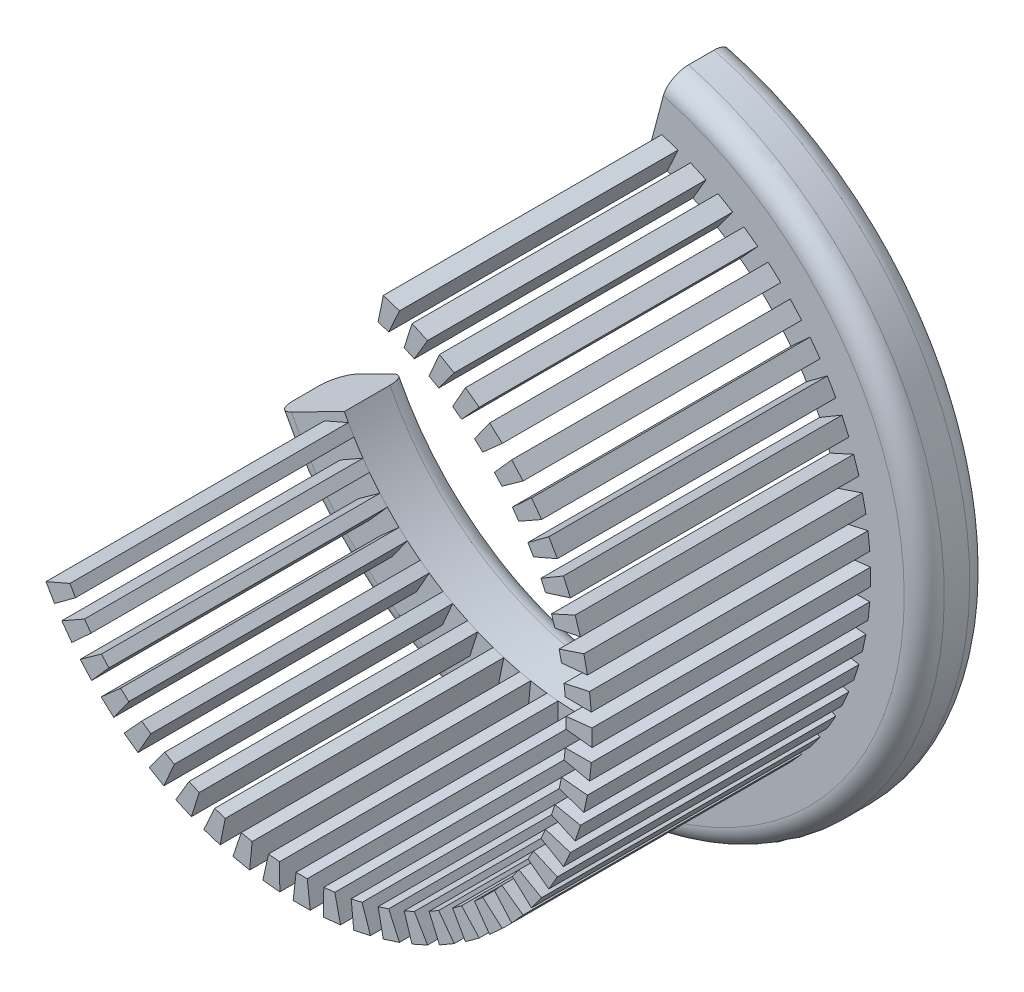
from build123d import *

# Parameters (mm, degrees)
P_IDAT_VYSUNUT_M1_DEPTH    = 85
P_IDAT_VYSUNUT_M1_2_DEPTH  = 85
P_IDAT_VYSUNUT_M1_3_DEPTH  = 85
P_IDAT_VYSUNUT_M1_4_DEPTH  = 85
P_IDAT_VYSUNUT_M1_5_DEPTH  = 85
P_IDAT_VYSUNUT_M1_6_DEPTH  = 85
P_IDAT_VYSUNUT_M1_7_DEPTH  = 85
P_IDAT_VYSUNUT_M1_8_DEPTH  = 85
P_IDAT_VYSUNUT_M1_9_DEPTH  = 85
P_IDAT_VYSUNUT_M1_10_DEPTH = 85
P_IDAT_VYSUNUT_M1_11_DEPTH = 85
P_IDAT_VYSUNUT_M1_12_DEPTH = 85
P_IDAT_VYSUNUT_M1_13_DEPTH = 85
P_IDAT_VYSUNUT_M1_14_DEPTH = 85
P_IDAT_VYSUNUT_M1_15_DEPTH = 85
P_IDAT_VYSUNUT_M1_16_DEPTH = 85
P_IDAT_VYSUNUT_M1_17_DEPTH = 85
P_IDAT_VYSUNUT_M1_18_DEPTH = 85
P_IDAT_VYSUNUT_M1_19_DEPTH = 85
P_IDAT_VYSUNUT_M1_20_DEPTH = 85
P_IDAT_VYSUNUT_M1_21_DEPTH = 85
P_IDAT_VYSUNUT_M1_22_DEPTH = 85
P_IDAT_VYSUNUT_M1_23_DEPTH = 85
P_IDAT_VYSUNUT_M1_24_DEPTH = 85
P_IDAT_VYSUNUT_M1_25_DEPTH = 85
P_IDAT_VYSUNUT_M1_26_DEPTH = 85
P_IDAT_VYSUNUT_M1_27_DEPTH = 85
P_IDAT_VYSUNUT_M1_28_DEPTH = 85
P_IDAT_VYSUNUT_M1_29_DEPTH = 85
P_IDAT_VYSUNUT_M1_30_DEPTH = 85
P_IDAT_VYSUNUT_M1_31_DEPTH = 85
P_IDAT_VYSUNUT_M1_32_DEPTH = 85
P_IDAT_VYSUNUT_M1_33_DEPTH = 85
P_IDAT_VYSUNUT_M1_34_DEPTH = 85
P_IDAT_VYSUNUT_M1_35_DEPTH = 85
P_IDAT_VYSUNUT_M1_36_DEPTH = 85
P_IDAT_VYSUNUT_M1_37_DEPTH = 85
P_IDAT_VYSUNUT_M1_38_DEPTH = 85
P_IDAT_VYSUNUT_M1_39_DEPTH = 85
P_IDAT_VYSUNUT_M1_40_DEPTH = 85
P_IDAT_VYSUNUT_M1_41_DEPTH = 85
P_IDAT_VYSUNUT_M1_42_DEPTH = 85
P_IDAT_VYSUNUT_M1_43_DEPTH = 85
P_IDAT_VYSUNUT_M1_44_DEPTH = 85
P_IDAT_VYSUNUT_M1_45_DEPTH = 85
P_IDAT_VYSUNUT_M1_46_DEPTH = 85
P_IDAT_VYSUNUT_M1_47_DEPTH = 85
P_IDAT_VYSUNUT_M1_48_DEPTH = 85
P_IDAT_VYSUNUT_M1_49_DEPTH = 85
P_IDAT_VYSUNUT_M1_50_DEPTH = 85
P_IDAT_VYSUNUT_M1_51_DEPTH = 85
P_IDAT_VYSUNUT_M1_52_DEPTH = 85
P_IDAT_VYSUNUT_M1_53_DEPTH = 85
P_IDAT_VYSUNUT_M1_54_DEPTH = 85
P_IDAT_VYSUNUT_M1_55_DEPTH = 85
P_IDAT_VYSUNUT_M1_56_DEPTH = 85
P_IDAT_VYSUNUT_M1_57_DEPTH = 85
P_IDAT_VYSUNUT_M1_58_DEPTH = 85
P_IDAT_VYSUNUT_M1_59_DEPTH = 85
P_IDAT_VYSUNUT_M1_60_DEPTH = 85
SKICA2_R                   = 105
SKICA2_R_2                 = 80.717903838
P_IDAT_VYSUNUT_M2_DEPTH    = 20
M_TKO1_SCALE               = 0.655
ODEBRAT_VYSUNUT_M1_DEPTH   = 120.121794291
ZAOBLIT1_R                 = 4


with BuildPart() as part:
    # Skica1 → P_idat vysunut_m1 (new body)
    with BuildSketch(Plane.XY):
        Polygon((-2.6, 88.6), (2.6, 88.6), (1.7, 80.7), (-1.7, 80.7), align=None)
    extrude(amount=P_IDAT_VYSUNUT_M1_DEPTH)



with BuildPart() as body_2:
    # Skica1 → P_idat vysunut_m1 2 (new body)
    with BuildSketch(Plane.XY):
        Polygon((6.744759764, 80.435615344), (10.126134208, 80.080218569), (11.846978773, 87.842865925), (6.675464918, 88.386413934), align=None)
    extrude(amount=P_IDAT_VYSUNUT_M1_2_DEPTH)


with BuildPart() as body_3:
    # Skica1 → P_idat vysunut_m1 3 (new body)
    with BuildSketch(Plane.XY):
        Polygon((15.115622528, 79.289961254), (18.44132437, 78.583061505), (20.964159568, 86.123307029), (15.877792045, 87.204447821), align=None)
    extrude(amount=P_IDAT_VYSUNUT_M1_3_DEPTH)


with BuildPart() as body_4:
    # Skica1 → P_idat vysunut_m1 4 (new body)
    with BuildSketch(Plane.XY):
        Polygon((23.320875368, 77.275589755), (26.554467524, 76.224931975), (29.851652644, 83.460163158), (24.906158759, 85.067051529), align=None)
    extrude(amount=P_IDAT_VYSUNUT_M1_4_DEPTH)


with BuildPart() as body_5:
    # Skica1 → P_idat vysunut_m1 5 (new body)
    with BuildSketch(Plane.XY):
        Polygon((31.270619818, 74.414570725), (34.376674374, 73.031666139), (38.412084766, 79.882612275), (33.661648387, 81.997642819), align=None)
    extrude(amount=P_IDAT_VYSUNUT_M1_5_DEPTH)


with BuildPart() as body_6:
    # Skica1 → P_idat vysunut_m1 6 (new body)
    with BuildSketch(Plane.XY):
        Polygon((38.877756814, 70.738250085), (41.822243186, 69.038250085), (46.55166605, 75.429850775), (42.04833395, 78.029850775), align=None)
    extrude(amount=P_IDAT_VYSUNUT_M1_6_DEPTH)


with BuildPart() as body_7:
    # Skica1 → P_idat vysunut_m1 7 (new body)
    with BuildSketch(Plane.XY):
        Polygon((46.05894097, 66.286906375), (48.80959875, 64.288436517), (54.181217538, 70.150664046), (49.974329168, 73.207147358), align=None)
    extrude(amount=P_IDAT_VYSUNUT_M1_7_DEPTH)


with BuildPart() as body_8:
    # Skica1 → P_idat vysunut_m1 8 (new body)
    with BuildSketch(Plane.XY):
        Polygon((52.73549373, 61.109309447), (55.262186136, 58.834265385), (61.21714827, 64.102891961), (57.352795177, 67.582371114), align=None)
    extrude(amount=P_IDAT_VYSUNUT_M1_8_DEPTH)


with BuildPart() as body_9:
    # Skica1 → P_idat vysunut_m1 9 (new body)
    with BuildSketch(Plane.XY):
        Polygon((58.834265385, 55.262186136), (61.109309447, 52.73549373), (67.582371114, 57.352795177), (64.102891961, 61.21714827), align=None)
    extrude(amount=P_IDAT_VYSUNUT_M1_9_DEPTH)


with BuildPart() as body_10:
    # Skica1 → P_idat vysunut_m1 10 (new body)
    with BuildSketch(Plane.XY):
        Polygon((64.288436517, 48.80959875), (66.286906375, 46.05894097), (73.207147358, 49.974329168), (70.150664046, 54.181217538), align=None)
    extrude(amount=P_IDAT_VYSUNUT_M1_10_DEPTH)


with BuildPart() as body_11:
    # Skica1 → P_idat vysunut_m1 11 (new body)
    with BuildSketch(Plane.XY):
        Polygon((69.038250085, 41.822243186), (70.738250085, 38.877756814), (78.029850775, 42.04833395), (75.429850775, 46.55166605), align=None)
    extrude(amount=P_IDAT_VYSUNUT_M1_11_DEPTH)


with BuildPart() as body_12:
    # Skica1 → P_idat vysunut_m1 12 (new body)
    with BuildSketch(Plane.XY):
        Polygon((73.031666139, 34.376674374), (74.414570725, 31.270619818), (81.997642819, 33.661648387), (79.882612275, 38.412084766), align=None)
    extrude(amount=P_IDAT_VYSUNUT_M1_12_DEPTH)


with BuildPart() as body_13:
    # Skica1 → P_idat vysunut_m1 13 (new body)
    with BuildSketch(Plane.XY):
        Polygon((76.224931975, 26.554467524), (77.275589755, 23.320875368), (85.067051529, 24.906158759), (83.460163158, 29.851652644), align=None)
    extrude(amount=P_IDAT_VYSUNUT_M1_13_DEPTH)


with BuildPart() as body_14:
    # Skica1 → P_idat vysunut_m1 14 (new body)
    with BuildSketch(Plane.XY):
        Polygon((78.583061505, 18.44132437), (79.289961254, 15.115622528), (87.204447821, 15.877792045), (86.123307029, 20.964159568), align=None)
    extrude(amount=P_IDAT_VYSUNUT_M1_14_DEPTH)


with BuildPart() as body_15:
    # Skica1 → P_idat vysunut_m1 15 (new body)
    with BuildSketch(Plane.XY):
        Polygon((80.080218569, 10.126134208), (80.435615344, 6.744759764), (88.386413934, 6.675464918), (87.842865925, 11.846978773), align=None)
    extrude(amount=P_IDAT_VYSUNUT_M1_15_DEPTH)


with BuildPart() as body_16:
    # Skica1 → P_idat vysunut_m1 16 (new body)
    with BuildSketch(Plane.XY):
        Polygon((80.7, 1.7), (80.7, -1.7), (88.6, -2.6), (88.6, 2.6), align=None)
    extrude(amount=P_IDAT_VYSUNUT_M1_16_DEPTH)


with BuildPart() as body_17:
    # Skica1 → P_idat vysunut_m1 17 (new body)
    with BuildSketch(Plane.XY):
        Polygon((80.435615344, -6.744759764), (80.080218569, -10.126134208), (87.842865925, -11.846978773), (88.386413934, -6.675464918), align=None)
    extrude(amount=P_IDAT_VYSUNUT_M1_17_DEPTH)


with BuildPart() as body_18:
    # Skica1 → P_idat vysunut_m1 18 (new body)
    with BuildSketch(Plane.XY):
        Polygon((79.289961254, -15.115622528), (78.583061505, -18.44132437), (86.123307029, -20.964159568), (87.204447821, -15.877792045), align=None)
    extrude(amount=P_IDAT_VYSUNUT_M1_18_DEPTH)


with BuildPart() as body_19:
    # Skica1 → P_idat vysunut_m1 19 (new body)
    with BuildSketch(Plane.XY):
        Polygon((77.275589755, -23.320875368), (76.224931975, -26.554467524), (83.460163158, -29.851652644), (85.067051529, -24.906158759), align=None)
    extrude(amount=P_IDAT_VYSUNUT_M1_19_DEPTH)


with BuildPart() as body_20:
    # Skica1 → P_idat vysunut_m1 20 (new body)
    with BuildSketch(Plane.XY):
        Polygon((74.414570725, -31.270619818), (73.031666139, -34.376674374), (79.882612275, -38.412084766), (81.997642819, -33.661648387), align=None)
    extrude(amount=P_IDAT_VYSUNUT_M1_20_DEPTH)


with BuildPart() as body_21:
    # Skica1 → P_idat vysunut_m1 21 (new body)
    with BuildSketch(Plane.XY):
        Polygon((70.738250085, -38.877756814), (69.038250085, -41.822243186), (75.429850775, -46.55166605), (78.029850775, -42.04833395), align=None)
    extrude(amount=P_IDAT_VYSUNUT_M1_21_DEPTH)


with BuildPart() as body_22:
    # Skica1 → P_idat vysunut_m1 22 (new body)
    with BuildSketch(Plane.XY):
        Polygon((66.286906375, -46.05894097), (64.288436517, -48.80959875), (70.150664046, -54.181217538), (73.207147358, -49.974329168), align=None)
    extrude(amount=P_IDAT_VYSUNUT_M1_22_DEPTH)


with BuildPart() as body_23:
    # Skica1 → P_idat vysunut_m1 23 (new body)
    with BuildSketch(Plane.XY):
        Polygon((61.109309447, -52.73549373), (58.834265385, -55.262186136), (64.102891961, -61.21714827), (67.582371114, -57.352795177), align=None)
    extrude(amount=P_IDAT_VYSUNUT_M1_23_DEPTH)


with BuildPart() as body_24:
    # Skica1 → P_idat vysunut_m1 24 (new body)
    with BuildSketch(Plane.XY):
        Polygon((55.262186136, -58.834265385), (52.73549373, -61.109309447), (57.352795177, -67.582371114), (61.21714827, -64.102891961), align=None)
    extrude(amount=P_IDAT_VYSUNUT_M1_24_DEPTH)


with BuildPart() as body_25:
    # Skica1 → P_idat vysunut_m1 25 (new body)
    with BuildSketch(Plane.XY):
        Polygon((48.80959875, -64.288436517), (46.05894097, -66.286906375), (49.974329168, -73.207147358), (54.181217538, -70.150664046), align=None)
    extrude(amount=P_IDAT_VYSUNUT_M1_25_DEPTH)


with BuildPart() as body_26:
    # Skica1 → P_idat vysunut_m1 26 (new body)
    with BuildSketch(Plane.XY):
        Polygon((41.822243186, -69.038250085), (38.877756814, -70.738250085), (42.04833395, -78.029850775), (46.55166605, -75.429850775), align=None)
    extrude(amount=P_IDAT_VYSUNUT_M1_26_DEPTH)


with BuildPart() as body_27:
    # Skica1 → P_idat vysunut_m1 27 (new body)
    with BuildSketch(Plane.XY):
        Polygon((34.376674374, -73.031666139), (31.270619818, -74.414570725), (33.661648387, -81.997642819), (38.412084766, -79.882612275), align=None)
    extrude(amount=P_IDAT_VYSUNUT_M1_27_DEPTH)


with BuildPart() as body_28:
    # Skica1 → P_idat vysunut_m1 28 (new body)
    with BuildSketch(Plane.XY):
        Polygon((26.554467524, -76.224931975), (23.320875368, -77.275589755), (24.906158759, -85.067051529), (29.851652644, -83.460163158), align=None)
    extrude(amount=P_IDAT_VYSUNUT_M1_28_DEPTH)


with BuildPart() as body_29:
    # Skica1 → P_idat vysunut_m1 29 (new body)
    with BuildSketch(Plane.XY):
        Polygon((18.44132437, -78.583061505), (15.115622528, -79.289961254), (15.877792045, -87.204447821), (20.964159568, -86.123307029), align=None)
    extrude(amount=P_IDAT_VYSUNUT_M1_29_DEPTH)


with BuildPart() as body_30:
    # Skica1 → P_idat vysunut_m1 30 (new body)
    with BuildSketch(Plane.XY):
        Polygon((10.126134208, -80.080218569), (6.744759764, -80.435615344), (6.675464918, -88.386413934), (11.846978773, -87.842865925), align=None)
    extrude(amount=P_IDAT_VYSUNUT_M1_30_DEPTH)


with BuildPart() as body_31:
    # Skica1 → P_idat vysunut_m1 31 (new body)
    with BuildSketch(Plane.XY):
        Polygon((1.7, -80.7), (-1.7, -80.7), (-2.6, -88.6), (2.6, -88.6), align=None)
    extrude(amount=P_IDAT_VYSUNUT_M1_31_DEPTH)


with BuildPart() as body_32:
    # Skica1 → P_idat vysunut_m1 32 (new body)
    with BuildSketch(Plane.XY):
        Polygon((-6.744759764, -80.435615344), (-10.126134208, -80.080218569), (-11.846978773, -87.842865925), (-6.675464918, -88.386413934), align=None)
    extrude(amount=P_IDAT_VYSUNUT_M1_32_DEPTH)


with BuildPart() as body_33:
    # Skica1 → P_idat vysunut_m1 33 (new body)
    with BuildSketch(Plane.XY):
        Polygon((-15.115622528, -79.289961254), (-18.44132437, -78.583061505), (-20.964159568, -86.123307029), (-15.877792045, -87.204447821), align=None)
    extrude(amount=P_IDAT_VYSUNUT_M1_33_DEPTH)


with BuildPart() as body_34:
    # Skica1 → P_idat vysunut_m1 34 (new body)
    with BuildSketch(Plane.XY):
        Polygon((-23.320875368, -77.275589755), (-26.554467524, -76.224931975), (-29.851652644, -83.460163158), (-24.906158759, -85.067051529), align=None)
    extrude(amount=P_IDAT_VYSUNUT_M1_34_DEPTH)


with BuildPart() as body_35:
    # Skica1 → P_idat vysunut_m1 35 (new body)
    with BuildSketch(Plane.XY):
        Polygon((-31.270619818, -74.414570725), (-34.376674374, -73.031666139), (-38.412084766, -79.882612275), (-33.661648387, -81.997642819), align=None)
    extrude(amount=P_IDAT_VYSUNUT_M1_35_DEPTH)


with BuildPart() as body_36:
    # Skica1 → P_idat vysunut_m1 36 (new body)
    with BuildSketch(Plane.XY):
        Polygon((-38.877756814, -70.738250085), (-41.822243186, -69.038250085), (-46.55166605, -75.429850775), (-42.04833395, -78.029850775), align=None)
    extrude(amount=P_IDAT_VYSUNUT_M1_36_DEPTH)


with BuildPart() as body_37:
    # Skica1 → P_idat vysunut_m1 37 (new body)
    with BuildSketch(Plane.XY):
        Polygon((-46.05894097, -66.286906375), (-48.80959875, -64.288436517), (-54.181217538, -70.150664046), (-49.974329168, -73.207147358), align=None)
    extrude(amount=P_IDAT_VYSUNUT_M1_37_DEPTH)


with BuildPart() as body_38:
    # Skica1 → P_idat vysunut_m1 38 (new body)
    with BuildSketch(Plane.XY):
        Polygon((-57.352795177, -67.582371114), (-52.73549373, -61.109309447), (-55.262186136, -58.834265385), (-61.21714827, -64.102891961), align=None)
    extrude(amount=P_IDAT_VYSUNUT_M1_38_DEPTH)


with BuildPart() as body_39:
    # Skica1 → P_idat vysunut_m1 39 (new body)
    with BuildSketch(Plane.XY):
        Polygon((-64.102891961, -61.21714827), (-58.834265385, -55.262186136), (-61.109309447, -52.73549373), (-67.582371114, -57.352795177), align=None)
    extrude(amount=P_IDAT_VYSUNUT_M1_39_DEPTH)


with BuildPart() as body_40:
    # Skica1 → P_idat vysunut_m1 40 (new body)
    with BuildSketch(Plane.XY):
        Polygon((-70.150664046, -54.181217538), (-64.288436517, -48.80959875), (-66.286906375, -46.05894097), (-73.207147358, -49.974329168), align=None)
    extrude(amount=P_IDAT_VYSUNUT_M1_40_DEPTH)


with BuildPart() as body_41:
    # Skica1 → P_idat vysunut_m1 41 (new body)
    with BuildSketch(Plane.XY):
        Polygon((-75.429850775, -46.55166605), (-69.038250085, -41.822243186), (-70.738250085, -38.877756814), (-78.029850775, -42.04833395), align=None)
    extrude(amount=P_IDAT_VYSUNUT_M1_41_DEPTH)


with BuildPart() as body_42:
    # Skica1 → P_idat vysunut_m1 42 (new body)
    with BuildSketch(Plane.XY):
        Polygon((-79.882612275, -38.412084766), (-73.031666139, -34.376674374), (-74.414570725, -31.270619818), (-81.997642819, -33.661648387), align=None)
    extrude(amount=P_IDAT_VYSUNUT_M1_42_DEPTH)


with BuildPart() as body_43:
    # Skica1 → P_idat vysunut_m1 43 (new body)
    with BuildSketch(Plane.XY):
        Polygon((-83.460163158, -29.851652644), (-76.224931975, -26.554467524), (-77.275589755, -23.320875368), (-85.067051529, -24.906158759), align=None)
    extrude(amount=P_IDAT_VYSUNUT_M1_43_DEPTH)


with BuildPart() as body_44:
    # Skica1 → P_idat vysunut_m1 44 (new body)
    with BuildSketch(Plane.XY):
        Polygon((-86.123307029, -20.964159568), (-78.583061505, -18.44132437), (-79.289961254, -15.115622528), (-87.204447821, -15.877792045), align=None)
    extrude(amount=P_IDAT_VYSUNUT_M1_44_DEPTH)


with BuildPart() as body_45:
    # Skica1 → P_idat vysunut_m1 45 (new body)
    with BuildSketch(Plane.XY):
        Polygon((-87.842865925, -11.846978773), (-80.080218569, -10.126134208), (-80.435615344, -6.744759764), (-88.386413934, -6.675464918), align=None)
    extrude(amount=P_IDAT_VYSUNUT_M1_45_DEPTH)


with BuildPart() as body_46:
    # Skica1 → P_idat vysunut_m1 46 (new body)
    with BuildSketch(Plane.XY):
        Polygon((-88.6, -2.6), (-80.7, -1.7), (-80.7, 1.7), (-88.6, 2.6), align=None)
    extrude(amount=P_IDAT_VYSUNUT_M1_46_DEPTH)


with BuildPart() as body_47:
    # Skica1 → P_idat vysunut_m1 47 (new body)
    with BuildSketch(Plane.XY):
        Polygon((-88.386413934, 6.675464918), (-80.435615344, 6.744759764), (-80.080218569, 10.126134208), (-87.842865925, 11.846978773), align=None)
    extrude(amount=P_IDAT_VYSUNUT_M1_47_DEPTH)


with BuildPart() as body_48:
    # Skica1 → P_idat vysunut_m1 48 (new body)
    with BuildSketch(Plane.XY):
        Polygon((-87.204447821, 15.877792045), (-79.289961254, 15.115622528), (-78.583061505, 18.44132437), (-86.123307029, 20.964159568), align=None)
    extrude(amount=P_IDAT_VYSUNUT_M1_48_DEPTH)


with BuildPart() as body_49:
    # Skica1 → P_idat vysunut_m1 49 (new body)
    with BuildSketch(Plane.XY):
        Polygon((-85.067051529, 24.906158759), (-77.275589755, 23.320875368), (-76.224931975, 26.554467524), (-83.460163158, 29.851652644), align=None)
    extrude(amount=P_IDAT_VYSUNUT_M1_49_DEPTH)


with BuildPart() as body_50:
    # Skica1 → P_idat vysunut_m1 50 (new body)
    with BuildSketch(Plane.XY):
        Polygon((-81.997642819, 33.661648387), (-74.414570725, 31.270619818), (-73.031666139, 34.376674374), (-79.882612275, 38.412084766), align=None)
    extrude(amount=P_IDAT_VYSUNUT_M1_50_DEPTH)


with BuildPart() as body_51:
    # Skica1 → P_idat vysunut_m1 51 (new body)
    with BuildSketch(Plane.XY):
        Polygon((-78.029850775, 42.04833395), (-70.738250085, 38.877756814), (-69.038250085, 41.822243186), (-75.429850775, 46.55166605), align=None)
    extrude(amount=P_IDAT_VYSUNUT_M1_51_DEPTH)


with BuildPart() as body_52:
    # Skica1 → P_idat vysunut_m1 52 (new body)
    with BuildSketch(Plane.XY):
        Polygon((-73.207147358, 49.974329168), (-66.286906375, 46.05894097), (-64.288436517, 48.80959875), (-70.150664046, 54.181217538), align=None)
    extrude(amount=P_IDAT_VYSUNUT_M1_52_DEPTH)


with BuildPart() as body_53:
    # Skica1 → P_idat vysunut_m1 53 (new body)
    with BuildSketch(Plane.XY):
        Polygon((-67.582371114, 57.352795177), (-61.109309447, 52.73549373), (-58.834265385, 55.262186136), (-64.102891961, 61.21714827), align=None)
    extrude(amount=P_IDAT_VYSUNUT_M1_53_DEPTH)


with BuildPart() as body_54:
    # Skica1 → P_idat vysunut_m1 54 (new body)
    with BuildSketch(Plane.XY):
        Polygon((-61.21714827, 64.102891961), (-55.262186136, 58.834265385), (-52.73549373, 61.109309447), (-57.352795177, 67.582371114), align=None)
    extrude(amount=P_IDAT_VYSUNUT_M1_54_DEPTH)


with BuildPart() as body_55:
    # Skica1 → P_idat vysunut_m1 55 (new body)
    with BuildSketch(Plane.XY):
        Polygon((-54.181217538, 70.150664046), (-48.80959875, 64.288436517), (-46.05894097, 66.286906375), (-49.974329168, 73.207147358), align=None)
    extrude(amount=P_IDAT_VYSUNUT_M1_55_DEPTH)


with BuildPart() as body_56:
    # Skica1 → P_idat vysunut_m1 56 (new body)
    with BuildSketch(Plane.XY):
        Polygon((-46.55166605, 75.429850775), (-41.822243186, 69.038250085), (-38.877756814, 70.738250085), (-42.04833395, 78.029850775), align=None)
    extrude(amount=P_IDAT_VYSUNUT_M1_56_DEPTH)


with BuildPart() as body_57:
    # Skica1 → P_idat vysunut_m1 57 (new body)
    with BuildSketch(Plane.XY):
        Polygon((-38.412084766, 79.882612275), (-34.376674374, 73.031666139), (-31.270619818, 74.414570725), (-33.661648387, 81.997642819), align=None)
    extrude(amount=P_IDAT_VYSUNUT_M1_57_DEPTH)


with BuildPart() as body_58:
    # Skica1 → P_idat vysunut_m1 58 (new body)
    with BuildSketch(Plane.XY):
        Polygon((-29.851652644, 83.460163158), (-26.554467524, 76.224931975), (-23.320875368, 77.275589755), (-24.906158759, 85.067051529), align=None)
    extrude(amount=P_IDAT_VYSUNUT_M1_58_DEPTH)


with BuildPart() as body_59:
    # Skica1 → P_idat vysunut_m1 59 (new body)
    with BuildSketch(Plane.XY):
        Polygon((-20.964159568, 86.123307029), (-18.44132437, 78.583061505), (-15.115622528, 79.289961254), (-15.877792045, 87.204447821), align=None)
    extrude(amount=P_IDAT_VYSUNUT_M1_59_DEPTH)


with BuildPart() as body_60:
    # Skica1 → P_idat vysunut_m1 60 (new body)
    with BuildSketch(Plane.XY):
        Polygon((-11.846978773, 87.842865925), (-10.126134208, 80.080218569), (-6.744759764, 80.435615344), (-6.675464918, 88.386413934), align=None)
    extrude(amount=P_IDAT_VYSUNUT_M1_60_DEPTH)


with BuildPart() as part_1:
    add(part.part)

    add(body_2.part)  # P_idat vysunut_m2 merges body 2

    add(body_3.part)  # P_idat vysunut_m2 merges body 3

    add(body_4.part)  # P_idat vysunut_m2 merges body 4

    add(body_5.part)  # P_idat vysunut_m2 merges body 5

    add(body_6.part)  # P_idat vysunut_m2 merges body 6

    add(body_7.part)  # P_idat vysunut_m2 merges body 7

    add(body_8.part)  # P_idat vysunut_m2 merges body 8

    add(body_9.part)  # P_idat vysunut_m2 merges body 9

    add(body_10.part)  # P_idat vysunut_m2 merges body 10

    add(body_11.part)  # P_idat vysunut_m2 merges body 11

    add(body_12.part)  # P_idat vysunut_m2 merges body 12

    add(body_13.part)  # P_idat vysunut_m2 merges body 13

    add(body_14.part)  # P_idat vysunut_m2 merges body 14

    add(body_15.part)  # P_idat vysunut_m2 merges body 15

    add(body_16.part)  # P_idat vysunut_m2 merges body 16

    add(body_17.part)  # P_idat vysunut_m2 merges body 17

    add(body_18.part)  # P_idat vysunut_m2 merges body 18

    add(body_19.part)  # P_idat vysunut_m2 merges body 19

    add(body_20.part)  # P_idat vysunut_m2 merges body 20

    add(body_21.part)  # P_idat vysunut_m2 merges body 21

    add(body_22.part)  # P_idat vysunut_m2 merges body 22

    add(body_23.part)  # P_idat vysunut_m2 merges body 23

    add(body_24.part)  # P_idat vysunut_m2 merges body 24

    add(body_25.part)  # P_idat vysunut_m2 merges body 25

    add(body_26.part)  # P_idat vysunut_m2 merges body 26

    add(body_27.part)  # P_idat vysunut_m2 merges body 27

    add(body_28.part)  # P_idat vysunut_m2 merges body 28

    add(body_29.part)  # P_idat vysunut_m2 merges body 29

    add(body_30.part)  # P_idat vysunut_m2 merges body 30

    add(body_31.part)  # P_idat vysunut_m2 merges body 31

    add(body_32.part)  # P_idat vysunut_m2 merges body 32

    add(body_33.part)  # P_idat vysunut_m2 merges body 33

    add(body_34.part)  # P_idat vysunut_m2 merges body 34

    add(body_35.part)  # P_idat vysunut_m2 merges body 35

    add(body_36.part)  # P_idat vysunut_m2 merges body 36

    add(body_37.part)  # P_idat vysunut_m2 merges body 37

    add(body_38.part)  # P_idat vysunut_m2 merges body 38

    add(body_39.part)  # P_idat vysunut_m2 merges body 39

    add(body_40.part)  # P_idat vysunut_m2 merges body 40

    add(body_41.part)  # P_idat vysunut_m2 merges body 41

    add(body_42.part)  # P_idat vysunut_m2 merges body 42

    add(body_43.part)  # P_idat vysunut_m2 merges body 43

    add(body_44.part)  # P_idat vysunut_m2 merges body 44

    add(body_45.part)  # P_idat vysunut_m2 merges body 45

    add(body_46.part)  # P_idat vysunut_m2 merges body 46

    add(body_47.part)  # P_idat vysunut_m2 merges body 47

    add(body_48.part)  # P_idat vysunut_m2 merges body 48

    add(body_49.part)  # P_idat vysunut_m2 merges body 49

    add(body_50.part)  # P_idat vysunut_m2 merges body 50

    add(body_51.part)  # P_idat vysunut_m2 merges body 51

    add(body_52.part)  # P_idat vysunut_m2 merges body 52

    add(body_53.part)  # P_idat vysunut_m2 merges body 53

    add(body_54.part)  # P_idat vysunut_m2 merges body 54

    add(body_55.part)  # P_idat vysunut_m2 merges body 55

    add(body_56.part)  # P_idat vysunut_m2 merges body 56

    add(body_57.part)  # P_idat vysunut_m2 merges body 57

    add(body_58.part)  # P_idat vysunut_m2 merges body 58

    add(body_59.part)  # P_idat vysunut_m2 merges body 59

    add(body_60.part)  # P_idat vysunut_m2 merges body 60
    # Skica2 → P_idat vysunut_m2 (add)
    with BuildSketch(Plane.XY):
        Circle(SKICA2_R)
        Circle(SKICA2_R_2, mode=Mode.SUBTRACT)
    extrude(amount=-P_IDAT_VYSUNUT_M2_DEPTH)


with BuildPart() as part_2:
    # M_tko1: scaled about (0, 0, 0)
    add(part_1.part.scale(M_TKO1_SCALE))

    # Skica3 → Odebrat vysunut_m1 (cut, through all)
    # profile 1 of 3: a face of its own
    with BuildSketch(Plane(origin=(0, 0, -13.1), x_dir=(-1, 0, 0), z_dir=(0, 0, -1))):
        with BuildLine():
            ThreePointArc((93.152701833, 0), (-90.592817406, 21.687952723), (83.053858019, -42.18391313))
            ThreePointArc((83.053858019, -42.18391313), (90.592817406, -21.687952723), (93.152701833, 0))
        make_face()
        with BuildLine():
            ThreePointArc((61.318984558, -31.144546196), (-53.468215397, -43.256797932), (-17.653582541, 66.470682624))
            ThreePointArc((-17.653582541, 66.470682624), (41.92776816, 54.516629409), (68.775, 0))
            ThreePointArc((68.775, 0), (66.885027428, -16.012299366), (61.318984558, -31.144546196))
        make_face(mode=Mode.SUBTRACT)
    # profile 2 of 3: a face of its own
    with BuildSketch(Plane(origin=(0, 0, -13.1), x_dir=(-1, 0, 0), z_dir=(0, 0, -1))):
        with BuildLine():
            Line((-17.653582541, 66.470682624), (-13.571049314, 51.098801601))
            ThreePointArc((-13.571049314, 51.098801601), (32.23163389, 41.909219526), (52.870227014, 0))
            ThreePointArc((52.870227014, 0), (51.41732583, -12.3093261), (47.138475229, -23.942118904))
            Line((47.138475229, -23.942118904), (61.318984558, -31.144546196))
            ThreePointArc((61.318984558, -31.144546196), (66.885027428, -16.012299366), (68.775, 0))
            ThreePointArc((68.775, 0), (41.92776816, 54.516629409), (-17.653582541, 66.470682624))
        make_face()
    # profile 3 of 3: a face of its own
    with BuildSketch(Plane(origin=(0, 0, -13.1), x_dir=(-1, 0, 0), z_dir=(0, 0, -1))):
        with BuildLine():
            Line((-13.571049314, 51.098801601), (0, 0))
            Line((0, 0), (47.138475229, -23.942118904))
            ThreePointArc((47.138475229, -23.942118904), (51.41732583, -12.3093261), (52.870227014, 0))
            ThreePointArc((52.870227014, 0), (32.23163389, 41.909219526), (-13.571049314, 51.098801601))
        make_face()
    extrude(amount=-ODEBRAT_VYSUNUT_M1_DEPTH, mode=Mode.SUBTRACT)

    # Zaoblit1
    zaoblit1_edges = [part_2.edges().sort_by_distance(p)[0] for p in [
        (41.103259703, -33.253314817, -13.1),
        (53.468215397, -43.256797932, -13.1),
        (53.468215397, -43.256797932, 0),
    ]]
    fillet(zaoblit1_edges, radius=ZAOBLIT1_R)


solid = part_2.part
